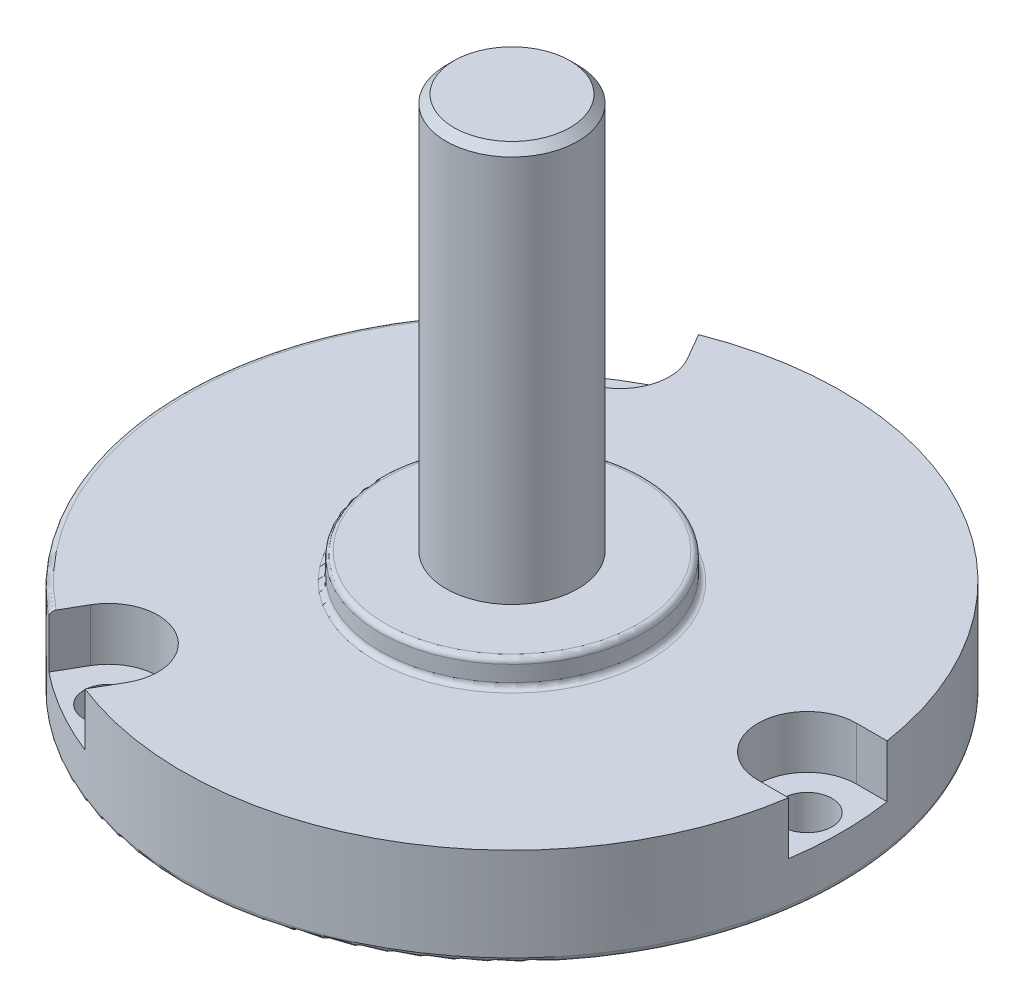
ISO-10303-21;
HEADER;
FILE_DESCRIPTION(('STEP AP214'),'2;1');
FILE_NAME('part.step','',(''),(''),'','','');
FILE_SCHEMA(('AUTOMOTIVE_DESIGN { 1 0 10303 214 1 1 1 1 }'));
ENDSEC;
DATA;
#1=APPLICATION_CONTEXT('core data for automotive mechanical design processes');
#2=APPLICATION_PROTOCOL_DEFINITION('international standard','automotive_design',2000,#1);
#3=PRODUCT_CONTEXT('',#1,'mechanical');
#4=PRODUCT('Part','Part','',(#3));
#5=PRODUCT_RELATED_PRODUCT_CATEGORY('part','',(#4));
#6=PRODUCT_DEFINITION_FORMATION('','',#4);
#7=PRODUCT_DEFINITION_CONTEXT('part definition',#1,'design');
#8=PRODUCT_DEFINITION('design','',#6,#7);
#9=PRODUCT_DEFINITION_SHAPE('','',#8);
#10=(LENGTH_UNIT() NAMED_UNIT(*) SI_UNIT(.MILLI.,.METRE.));
#11=(NAMED_UNIT(*) PLANE_ANGLE_UNIT() SI_UNIT($,.RADIAN.));
#12=(NAMED_UNIT(*) SI_UNIT($,.STERADIAN.) SOLID_ANGLE_UNIT());
#13=UNCERTAINTY_MEASURE_WITH_UNIT(LENGTH_MEASURE(1.E-05),#10,'distance_accuracy_value','');
#14=(GEOMETRIC_REPRESENTATION_CONTEXT(3) GLOBAL_UNCERTAINTY_ASSIGNED_CONTEXT((#13)) GLOBAL_UNIT_ASSIGNED_CONTEXT((#10,
#11,#12)) REPRESENTATION_CONTEXT('',''));
#15=CARTESIAN_POINT('',(0.,0.,0.));
#16=DIRECTION('',(0.,0.,1.));
#17=DIRECTION('',(1.,0.,0.));
#18=AXIS2_PLACEMENT_3D('',#15,#16,#17);
#19=CARTESIAN_POINT('',(0.,6.0198,0.));
#20=DIRECTION('',(0.,1.,0.));
#21=DIRECTION('',(0.,0.,1.));
#22=AXIS2_PLACEMENT_3D('',#19,#20,#21);
#23=PLANE('',#22);
#24=CARTESIAN_POINT('',(0.,6.0198,0.));
#25=DIRECTION('',(0.,1.,0.));
#26=DIRECTION('',(0.,0.,1.));
#27=AXIS2_PLACEMENT_3D('',#24,#25,#26);
#28=CIRCLE('',#27,6.096);
#29=CARTESIAN_POINT('',(0.,6.0198,6.096));
#30=VERTEX_POINT('',#29);
#31=EDGE_CURVE('E11',#30,#30,#28,.T.);
#32=ORIENTED_EDGE('',*,*,#31,.T.);
#33=EDGE_LOOP('',(#32));
#34=FACE_BOUND('',#33,.T.);
#35=CARTESIAN_POINT('',(0.,6.0198,0.));
#36=DIRECTION('',(0.,1.,0.));
#37=DIRECTION('',(0.,0.,1.));
#38=AXIS2_PLACEMENT_3D('',#35,#36,#37);
#39=CIRCLE('',#38,3.175);
#40=CARTESIAN_POINT('',(0.,6.0198,-3.175));
#41=VERTEX_POINT('',#40);
#42=EDGE_CURVE('E143',#41,#41,#39,.T.);
#43=ORIENTED_EDGE('',*,*,#42,.F.);
#44=EDGE_LOOP('',(#43));
#45=FACE_BOUND('',#44,.T.);
#46=ADVANCED_FACE('F35',(#34,#45),#23,.T.);
#47=CARTESIAN_POINT('',(-7.11199999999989,0.,-12.3183453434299));
#48=DIRECTION('',(0.,-1.,0.));
#49=DIRECTION('',(0.,0.,-1.));
#50=AXIS2_PLACEMENT_3D('',#47,#48,#49);
#51=CYLINDRICAL_SURFACE('',#50,1.190625);
#52=CARTESIAN_POINT('',(-7.11199999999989,0.,-12.3183453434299));
#53=DIRECTION('',(0.,-1.,0.));
#54=DIRECTION('',(0.,0.,-1.));
#55=AXIS2_PLACEMENT_3D('',#52,#53,#54);
#56=CIRCLE('',#55,1.190625);
#57=CARTESIAN_POINT('',(-7.11199999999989,0.,-13.5089703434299));
#58=VERTEX_POINT('',#57);
#59=EDGE_CURVE('E204',#58,#58,#56,.T.);
#60=ORIENTED_EDGE('',*,*,#59,.T.);
#61=EDGE_LOOP('',(#60));
#62=FACE_BOUND('',#61,.T.);
#63=CARTESIAN_POINT('',(-7.11199999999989,2.2098,-12.3183453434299));
#64=DIRECTION('',(0.,1.,0.));
#65=DIRECTION('',(0.,0.,1.));
#66=AXIS2_PLACEMENT_3D('',#63,#64,#65);
#67=CIRCLE('',#66,1.190625);
#68=CARTESIAN_POINT('',(-7.11199999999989,2.2098,-11.1277203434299));
#69=VERTEX_POINT('',#68);
#70=EDGE_CURVE('E173',#69,#69,#67,.F.);
#71=ORIENTED_EDGE('',*,*,#70,.F.);
#72=EDGE_LOOP('',(#71));
#73=FACE_BOUND('',#72,.T.);
#74=ADVANCED_FACE('F303',(#62,#73),#51,.F.);
#75=CARTESIAN_POINT('',(-7.11200000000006,0.,12.3183453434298));
#76=DIRECTION('',(0.,-1.,0.));
#77=DIRECTION('',(0.,0.,-1.));
#78=AXIS2_PLACEMENT_3D('',#75,#76,#77);
#79=CYLINDRICAL_SURFACE('',#78,1.190625);
#80=CARTESIAN_POINT('',(-7.11200000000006,0.,12.3183453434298));
#81=DIRECTION('',(0.,-1.,0.));
#82=DIRECTION('',(0.,0.,-1.));
#83=AXIS2_PLACEMENT_3D('',#80,#81,#82);
#84=CIRCLE('',#83,1.190625);
#85=CARTESIAN_POINT('',(-7.11200000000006,0.,11.1277203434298));
#86=VERTEX_POINT('',#85);
#87=EDGE_CURVE('E207',#86,#86,#84,.T.);
#88=ORIENTED_EDGE('',*,*,#87,.T.);
#89=EDGE_LOOP('',(#88));
#90=FACE_BOUND('',#89,.T.);
#91=CARTESIAN_POINT('',(-7.11200000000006,2.2098,12.3183453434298));
#92=DIRECTION('',(0.,1.,0.));
#93=DIRECTION('',(0.,0.,1.));
#94=AXIS2_PLACEMENT_3D('',#91,#92,#93);
#95=CIRCLE('',#94,1.190625);
#96=CARTESIAN_POINT('',(-7.11200000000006,2.2098,13.5089703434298));
#97=VERTEX_POINT('',#96);
#98=EDGE_CURVE('E198',#97,#97,#95,.F.);
#99=ORIENTED_EDGE('',*,*,#98,.F.);
#100=EDGE_LOOP('',(#99));
#101=FACE_BOUND('',#100,.T.);
#102=ADVANCED_FACE('F306',(#90,#101),#79,.F.);
#103=CARTESIAN_POINT('',(14.224,0.,0.));
#104=DIRECTION('',(0.,-1.,0.));
#105=DIRECTION('',(0.,0.,-1.));
#106=AXIS2_PLACEMENT_3D('',#103,#104,#105);
#107=CYLINDRICAL_SURFACE('',#106,1.190625);
#108=CARTESIAN_POINT('',(14.224,0.,0.));
#109=DIRECTION('',(0.,-1.,0.));
#110=DIRECTION('',(0.,0.,-1.));
#111=AXIS2_PLACEMENT_3D('',#108,#109,#110);
#112=CIRCLE('',#111,1.190625);
#113=CARTESIAN_POINT('',(14.224,0.,-1.190625));
#114=VERTEX_POINT('',#113);
#115=EDGE_CURVE('E240',#114,#114,#112,.T.);
#116=ORIENTED_EDGE('',*,*,#115,.T.);
#117=EDGE_LOOP('',(#116));
#118=FACE_BOUND('',#117,.T.);
#119=CARTESIAN_POINT('',(14.224,2.2098,0.));
#120=DIRECTION('',(0.,1.,0.));
#121=DIRECTION('',(0.,0.,1.));
#122=AXIS2_PLACEMENT_3D('',#119,#120,#121);
#123=CIRCLE('',#122,1.190625);
#124=CARTESIAN_POINT('',(14.224,2.2098,1.190625));
#125=VERTEX_POINT('',#124);
#126=EDGE_CURVE('E234',#125,#125,#123,.F.);
#127=ORIENTED_EDGE('',*,*,#126,.F.);
#128=EDGE_LOOP('',(#127));
#129=FACE_BOUND('',#128,.T.);
#130=ADVANCED_FACE('F310',(#118,#129),#107,.F.);
#131=CARTESIAN_POINT('',(0.,4.7498,0.));
#132=DIRECTION('',(0.,1.,0.));
#133=DIRECTION('',(0.,0.,1.));
#134=AXIS2_PLACEMENT_3D('',#131,#132,#133);
#135=PLANE('',#134);
#136=CARTESIAN_POINT('',(0.,4.7498,0.));
#137=DIRECTION('',(0.,1.,0.));
#138=DIRECTION('',(0.,0.,1.));
#139=AXIS2_PLACEMENT_3D('',#136,#137,#138);
#140=CIRCLE('',#139,6.604);
#141=CARTESIAN_POINT('',(0.,4.7498,6.604));
#142=VERTEX_POINT('',#141);
#143=EDGE_CURVE('E43',#142,#142,#140,.F.);
#144=ORIENTED_EDGE('',*,*,#143,.T.);
#145=EDGE_LOOP('',(#144));
#146=FACE_BOUND('',#145,.T.);
#147=DIRECTION('',(0.499999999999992,0.,0.866025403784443));
#148=VECTOR('',#147,1.);
#149=CARTESIAN_POINT('',(-9.16872373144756,4.7498,-11.1308953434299));
#150=LINE('',#149,#148);
#151=CARTESIAN_POINT('',(-9.77643051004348,4.7498,-12.1834743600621));
#152=VERTEX_POINT('',#151);
#153=CARTESIAN_POINT('',(-9.16872373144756,4.7498,-11.1308953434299));
#154=VERTEX_POINT('',#153);
#155=EDGE_CURVE('E131',#152,#154,#150,.T.);
#156=ORIENTED_EDGE('',*,*,#155,.F.);
#157=CARTESIAN_POINT('',(0.,4.7498,0.));
#158=DIRECTION('',(0.,1.,0.));
#159=DIRECTION('',(0.,0.,1.));
#160=AXIS2_PLACEMENT_3D('',#157,#158,#159);
#161=CIRCLE('',#160,15.621);
#162=CARTESIAN_POINT('',(-9.77643051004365,4.7498,12.183474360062));
#163=VERTEX_POINT('',#162);
#164=EDGE_CURVE('E273',#152,#163,#161,.T.);
#165=ORIENTED_EDGE('',*,*,#164,.T.);
#166=DIRECTION('',(-0.500000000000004,0.,0.866025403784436));
#167=VECTOR('',#166,1.);
#168=CARTESIAN_POINT('',(-9.16872373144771,4.7498,11.1308953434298));
#169=LINE('',#168,#167);
#170=CARTESIAN_POINT('',(-9.16872373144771,4.7498,11.1308953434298));
#171=VERTEX_POINT('',#170);
#172=EDGE_CURVE('E182',#171,#163,#169,.T.);
#173=ORIENTED_EDGE('',*,*,#172,.F.);
#174=CARTESIAN_POINT('',(-7.11200000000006,4.7498,12.3183453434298));
#175=DIRECTION('',(0.,1.,0.));
#176=DIRECTION('',(-0.866025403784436,0.,-0.500000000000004));
#177=AXIS2_PLACEMENT_3D('',#174,#175,#176);
#178=CIRCLE('',#177,2.3749);
#179=CARTESIAN_POINT('',(-5.0552762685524,4.7498,13.5057953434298));
#180=VERTEX_POINT('',#179);
#181=EDGE_CURVE('E179',#180,#171,#178,.T.);
#182=ORIENTED_EDGE('',*,*,#181,.F.);
#183=DIRECTION('',(0.500000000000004,0.,-0.866025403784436));
#184=VECTOR('',#183,1.);
#185=CARTESIAN_POINT('',(-5.0552762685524,4.7498,13.5057953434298));
#186=LINE('',#185,#184);
#187=CARTESIAN_POINT('',(-5.79145241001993,4.7498,14.7808898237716));
#188=VERTEX_POINT('',#187);
#189=EDGE_CURVE('E176',#188,#180,#186,.T.);
#190=ORIENTED_EDGE('',*,*,#189,.F.);
#191=CARTESIAN_POINT('',(0.,4.7498,0.));
#192=DIRECTION('',(0.,1.,0.));
#193=DIRECTION('',(0.,0.,1.));
#194=AXIS2_PLACEMENT_3D('',#191,#192,#193);
#195=CIRCLE('',#194,15.875);
#196=CARTESIAN_POINT('',(15.696352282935,4.7498,2.3749));
#197=VERTEX_POINT('',#196);
#198=EDGE_CURVE('E243',#188,#197,#195,.T.);
#199=ORIENTED_EDGE('',*,*,#198,.T.);
#200=DIRECTION('',(1.,0.,0.));
#201=VECTOR('',#200,1.);
#202=CARTESIAN_POINT('',(14.224,4.7498,2.3749));
#203=LINE('',#202,#201);
#204=CARTESIAN_POINT('',(14.224,4.7498,2.3749));
#205=VERTEX_POINT('',#204);
#206=EDGE_CURVE('E216',#205,#197,#203,.T.);
#207=ORIENTED_EDGE('',*,*,#206,.F.);
#208=CARTESIAN_POINT('',(14.224,4.7498,0.));
#209=DIRECTION('',(0.,1.,0.));
#210=DIRECTION('',(0.,0.,1.));
#211=AXIS2_PLACEMENT_3D('',#208,#209,#210);
#212=CIRCLE('',#211,2.3749);
#213=CARTESIAN_POINT('',(14.224,4.7498,-2.3749));
#214=VERTEX_POINT('',#213);
#215=EDGE_CURVE('E213',#214,#205,#212,.T.);
#216=ORIENTED_EDGE('',*,*,#215,.F.);
#217=DIRECTION('',(-1.,0.,0.));
#218=VECTOR('',#217,1.);
#219=CARTESIAN_POINT('',(14.224,4.7498,-2.3749));
#220=LINE('',#219,#218);
#221=CARTESIAN_POINT('',(15.696352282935,4.7498,-2.3749));
#222=VERTEX_POINT('',#221);
#223=EDGE_CURVE('E210',#222,#214,#220,.T.);
#224=ORIENTED_EDGE('',*,*,#223,.F.);
#225=CARTESIAN_POINT('',(-5.79145241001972,4.7498,-14.7808898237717));
#226=VERTEX_POINT('',#225);
#227=EDGE_CURVE('E244',#222,#226,#195,.T.);
#228=ORIENTED_EDGE('',*,*,#227,.T.);
#229=DIRECTION('',(-0.499999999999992,0.,-0.866025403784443));
#230=VECTOR('',#229,1.);
#231=CARTESIAN_POINT('',(-5.05527626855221,4.7498,-13.5057953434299));
#232=LINE('',#231,#230);
#233=CARTESIAN_POINT('',(-5.05527626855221,4.7498,-13.5057953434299));
#234=VERTEX_POINT('',#233);
#235=EDGE_CURVE('E157',#234,#226,#232,.T.);
#236=ORIENTED_EDGE('',*,*,#235,.F.);
#237=CARTESIAN_POINT('',(-7.11199999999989,4.7498,-12.3183453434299));
#238=DIRECTION('',(0.,1.,0.));
#239=DIRECTION('',(0.866025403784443,0.,-0.499999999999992));
#240=AXIS2_PLACEMENT_3D('',#237,#238,#239);
#241=CIRCLE('',#240,2.3749);
#242=EDGE_CURVE('E142',#154,#234,#241,.T.);
#243=ORIENTED_EDGE('',*,*,#242,.F.);
#244=EDGE_LOOP('',(#156,#165,#173,#182,#190,#199,#207,#216,#224,#228,#236,#243));
#245=FACE_BOUND('',#244,.T.);
#246=ADVANCED_FACE('F155',(#146,#245),#135,.T.);
#247=CARTESIAN_POINT('',(0.,4.7498,0.));
#248=DIRECTION('',(0.,-1.,0.));
#249=DIRECTION('',(0.,0.,-1.));
#250=AXIS2_PLACEMENT_3D('',#247,#248,#249);
#251=CYLINDRICAL_SURFACE('',#250,15.875);
#252=CARTESIAN_POINT('',(0.,0.254,0.));
#253=DIRECTION('',(0.,1.,0.));
#254=DIRECTION('',(0.,0.,1.));
#255=AXIS2_PLACEMENT_3D('',#252,#253,#254);
#256=CIRCLE('',#255,15.875);
#257=CARTESIAN_POINT('',(0.,0.254,15.875));
#258=VERTEX_POINT('',#257);
#259=EDGE_CURVE('E281',#258,#258,#256,.T.);
#260=ORIENTED_EDGE('',*,*,#259,.T.);
#261=EDGE_LOOP('',(#260));
#262=FACE_BOUND('',#261,.T.);
#263=DIRECTION('',(0.,1.,0.));
#264=VECTOR('',#263,1.);
#265=CARTESIAN_POINT('',(-9.90489987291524,2.2098,12.4059898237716));
#266=LINE('',#265,#264);
#267=CARTESIAN_POINT('',(-9.90489987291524,2.2098,12.4059898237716));
#268=VERTEX_POINT('',#267);
#269=CARTESIAN_POINT('',(-9.90489987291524,4.4958,12.4059898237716));
#270=VERTEX_POINT('',#269);
#271=EDGE_CURVE('E196',#268,#270,#266,.T.);
#272=ORIENTED_EDGE('',*,*,#271,.T.);
#273=CARTESIAN_POINT('',(0.,4.4958,0.));
#274=DIRECTION('',(0.,1.,0.));
#275=DIRECTION('',(0.,0.,1.));
#276=AXIS2_PLACEMENT_3D('',#273,#274,#275);
#277=CIRCLE('',#276,15.875);
#278=CARTESIAN_POINT('',(-9.90489987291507,4.4958,-12.4059898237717));
#279=VERTEX_POINT('',#278);
#280=EDGE_CURVE('E50',#270,#279,#277,.F.);
#281=ORIENTED_EDGE('',*,*,#280,.T.);
#282=DIRECTION('',(0.,1.,0.));
#283=VECTOR('',#282,1.);
#284=CARTESIAN_POINT('',(-9.90489987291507,2.2098,-12.4059898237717));
#285=LINE('',#284,#283);
#286=CARTESIAN_POINT('',(-9.90489987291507,2.2098,-12.4059898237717));
#287=VERTEX_POINT('',#286);
#288=EDGE_CURVE('E153',#287,#279,#285,.T.);
#289=ORIENTED_EDGE('',*,*,#288,.F.);
#290=CARTESIAN_POINT('',(0.,2.2098,0.));
#291=DIRECTION('',(0.,1.,0.));
#292=DIRECTION('',(0.866025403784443,0.,-0.499999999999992));
#293=AXIS2_PLACEMENT_3D('',#290,#291,#292);
#294=CIRCLE('',#293,15.875);
#295=CARTESIAN_POINT('',(-5.79145241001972,2.2098,-14.7808898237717));
#296=VERTEX_POINT('',#295);
#297=EDGE_CURVE('E159',#296,#287,#294,.T.);
#298=ORIENTED_EDGE('',*,*,#297,.F.);
#299=DIRECTION('',(0.,1.,0.));
#300=VECTOR('',#299,1.);
#301=CARTESIAN_POINT('',(-5.79145241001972,2.2098,-14.7808898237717));
#302=LINE('',#301,#300);
#303=EDGE_CURVE('E170',#296,#226,#302,.T.);
#304=ORIENTED_EDGE('',*,*,#303,.T.);
#305=ORIENTED_EDGE('',*,*,#227,.F.);
#306=DIRECTION('',(0.,1.,0.));
#307=VECTOR('',#306,1.);
#308=CARTESIAN_POINT('',(15.696352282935,2.2098,-2.3749));
#309=LINE('',#308,#307);
#310=CARTESIAN_POINT('',(15.696352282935,2.2098,-2.3749));
#311=VERTEX_POINT('',#310);
#312=EDGE_CURVE('E230',#311,#222,#309,.T.);
#313=ORIENTED_EDGE('',*,*,#312,.F.);
#314=CARTESIAN_POINT('',(0.,2.2098,0.));
#315=DIRECTION('',(0.,1.,0.));
#316=DIRECTION('',(0.,0.,1.));
#317=AXIS2_PLACEMENT_3D('',#314,#315,#316);
#318=CIRCLE('',#317,15.875);
#319=CARTESIAN_POINT('',(15.696352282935,2.2098,2.3749));
#320=VERTEX_POINT('',#319);
#321=EDGE_CURVE('E219',#320,#311,#318,.T.);
#322=ORIENTED_EDGE('',*,*,#321,.F.);
#323=DIRECTION('',(0.,1.,0.));
#324=VECTOR('',#323,1.);
#325=CARTESIAN_POINT('',(15.696352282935,2.2098,2.3749));
#326=LINE('',#325,#324);
#327=EDGE_CURVE('E231',#320,#197,#326,.T.);
#328=ORIENTED_EDGE('',*,*,#327,.T.);
#329=ORIENTED_EDGE('',*,*,#198,.F.);
#330=DIRECTION('',(0.,1.,0.));
#331=VECTOR('',#330,1.);
#332=CARTESIAN_POINT('',(-5.79145241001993,2.2098,14.7808898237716));
#333=LINE('',#332,#331);
#334=CARTESIAN_POINT('',(-5.79145241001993,2.2098,14.7808898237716));
#335=VERTEX_POINT('',#334);
#336=EDGE_CURVE('E195',#335,#188,#333,.T.);
#337=ORIENTED_EDGE('',*,*,#336,.F.);
#338=CARTESIAN_POINT('',(0.,2.2098,0.));
#339=DIRECTION('',(0.,1.,0.));
#340=DIRECTION('',(-0.866025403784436,0.,-0.500000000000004));
#341=AXIS2_PLACEMENT_3D('',#338,#339,#340);
#342=CIRCLE('',#341,15.875);
#343=EDGE_CURVE('E184',#268,#335,#342,.T.);
#344=ORIENTED_EDGE('',*,*,#343,.F.);
#345=EDGE_LOOP('',(#272,#281,#289,#298,#304,#305,#313,#322,#328,#329,#337,#344));
#346=FACE_BOUND('',#345,.T.);
#347=ADVANCED_FACE('F349',(#262,#346),#251,.T.);
#348=CARTESIAN_POINT('',(0.,0.,0.));
#349=DIRECTION('',(0.,1.,0.));
#350=DIRECTION('',(0.,0.,1.));
#351=AXIS2_PLACEMENT_3D('',#348,#349,#350);
#352=PLANE('',#351);
#353=CARTESIAN_POINT('',(0.,0.,0.));
#354=DIRECTION('',(0.,1.,0.));
#355=DIRECTION('',(0.,0.,1.));
#356=AXIS2_PLACEMENT_3D('',#353,#354,#355);
#357=CIRCLE('',#356,11.938);
#358=CARTESIAN_POINT('',(0.,0.,11.938));
#359=VERTEX_POINT('',#358);
#360=EDGE_CURVE('E270',#359,#359,#357,.T.);
#361=ORIENTED_EDGE('',*,*,#360,.T.);
#362=EDGE_LOOP('',(#361));
#363=FACE_BOUND('',#362,.T.);
#364=CARTESIAN_POINT('',(0.,0.,0.));
#365=DIRECTION('',(0.,1.,0.));
#366=DIRECTION('',(0.,0.,1.));
#367=AXIS2_PLACEMENT_3D('',#364,#365,#366);
#368=CIRCLE('',#367,15.621);
#369=CARTESIAN_POINT('',(0.,0.,15.621));
#370=VERTEX_POINT('',#369);
#371=EDGE_CURVE('E267',#370,#370,#368,.F.);
#372=ORIENTED_EDGE('',*,*,#371,.T.);
#373=EDGE_LOOP('',(#372));
#374=FACE_BOUND('',#373,.T.);
#375=ORIENTED_EDGE('',*,*,#59,.F.);
#376=EDGE_LOOP('',(#375));
#377=FACE_BOUND('',#376,.T.);
#378=ORIENTED_EDGE('',*,*,#87,.F.);
#379=EDGE_LOOP('',(#378));
#380=FACE_BOUND('',#379,.T.);
#381=ORIENTED_EDGE('',*,*,#115,.F.);
#382=EDGE_LOOP('',(#381));
#383=FACE_BOUND('',#382,.T.);
#384=ADVANCED_FACE('F345',(#363,#374,#377,#380,#383),#352,.F.);
#385=CARTESIAN_POINT('',(0.,6.0198,0.));
#386=DIRECTION('',(0.,-1.,0.));
#387=DIRECTION('',(0.,0.,-1.));
#388=AXIS2_PLACEMENT_3D('',#385,#386,#387);
#389=CYLINDRICAL_SURFACE('',#388,6.35);
#390=CARTESIAN_POINT('',(0.,5.0038,0.));
#391=DIRECTION('',(0.,1.,0.));
#392=DIRECTION('',(0.,0.,1.));
#393=AXIS2_PLACEMENT_3D('',#390,#391,#392);
#394=CIRCLE('',#393,6.35);
#395=CARTESIAN_POINT('',(0.,5.0038,6.35));
#396=VERTEX_POINT('',#395);
#397=EDGE_CURVE('E515',#396,#396,#394,.T.);
#398=ORIENTED_EDGE('',*,*,#397,.T.);
#399=EDGE_LOOP('',(#398));
#400=FACE_BOUND('',#399,.T.);
#401=CARTESIAN_POINT('',(0.,5.7658,0.));
#402=DIRECTION('',(0.,1.,0.));
#403=DIRECTION('',(0.,0.,1.));
#404=AXIS2_PLACEMENT_3D('',#401,#402,#403);
#405=CIRCLE('',#404,6.35);
#406=CARTESIAN_POINT('',(0.,5.7658,6.35));
#407=VERTEX_POINT('',#406);
#408=EDGE_CURVE('E400',#407,#407,#405,.F.);
#409=ORIENTED_EDGE('',*,*,#408,.T.);
#410=EDGE_LOOP('',(#409));
#411=FACE_BOUND('',#410,.T.);
#412=ADVANCED_FACE('F338',(#400,#411),#389,.T.);
#413=CARTESIAN_POINT('',(0.,0.762,0.));
#414=DIRECTION('',(0.,-1.,0.));
#415=DIRECTION('',(0.,0.,-1.));
#416=AXIS2_PLACEMENT_3D('',#413,#414,#415);
#417=CYLINDRICAL_SURFACE('',#416,11.684);
#418=CARTESIAN_POINT('',(0.,0.508,0.));
#419=DIRECTION('',(0.,-1.,0.));
#420=DIRECTION('',(0.,0.,-1.));
#421=AXIS2_PLACEMENT_3D('',#418,#419,#420);
#422=CIRCLE('',#421,11.684);
#423=CARTESIAN_POINT('',(0.,0.508,-11.684));
#424=VERTEX_POINT('',#423);
#425=EDGE_CURVE('E264',#424,#424,#422,.F.);
#426=CARTESIAN_POINT('',(0.,0.254,0.));
#427=DIRECTION('',(0.,1.,0.));
#428=DIRECTION('',(0.,0.,1.));
#429=AXIS2_PLACEMENT_3D('',#426,#427,#428);
#430=CIRCLE('',#429,11.684);
#431=CARTESIAN_POINT('',(0.,0.254,-11.684));
#432=VERTEX_POINT('',#431);
#433=EDGE_CURVE('E261',#432,#432,#430,.F.);
#434=CARTESIAN_POINT('',(0.,0.508,-11.684));
#435=CARTESIAN_POINT('',(0.,0.505354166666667,-11.684));
#436=CARTESIAN_POINT('',(0.,0.502708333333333,-11.684));
#437=CARTESIAN_POINT('',(0.,0.497416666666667,-11.684));
#438=CARTESIAN_POINT('',(0.,0.494770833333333,-11.684));
#439=CARTESIAN_POINT('',(0.,0.489479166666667,-11.684));
#440=CARTESIAN_POINT('',(0.,0.486833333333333,-11.684));
#441=CARTESIAN_POINT('',(0.,0.481541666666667,-11.684));
#442=CARTESIAN_POINT('',(0.,0.478895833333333,-11.684));
#443=CARTESIAN_POINT('',(0.,0.473604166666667,-11.684));
#444=CARTESIAN_POINT('',(0.,0.470958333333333,-11.684));
#445=CARTESIAN_POINT('',(0.,0.465666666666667,-11.684));
#446=CARTESIAN_POINT('',(0.,0.463020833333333,-11.684));
#447=CARTESIAN_POINT('',(0.,0.457729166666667,-11.684));
#448=CARTESIAN_POINT('',(0.,0.455083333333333,-11.684));
#449=CARTESIAN_POINT('',(0.,0.449791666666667,-11.684));
#450=CARTESIAN_POINT('',(0.,0.447145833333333,-11.684));
#451=CARTESIAN_POINT('',(0.,0.441854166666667,-11.684));
#452=CARTESIAN_POINT('',(0.,0.439208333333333,-11.684));
#453=CARTESIAN_POINT('',(0.,0.433916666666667,-11.684));
#454=CARTESIAN_POINT('',(0.,0.431270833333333,-11.684));
#455=CARTESIAN_POINT('',(0.,0.425979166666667,-11.684));
#456=CARTESIAN_POINT('',(0.,0.423333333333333,-11.684));
#457=CARTESIAN_POINT('',(0.,0.418041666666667,-11.684));
#458=CARTESIAN_POINT('',(0.,0.415395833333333,-11.684));
#459=CARTESIAN_POINT('',(0.,0.410104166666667,-11.684));
#460=CARTESIAN_POINT('',(0.,0.407458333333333,-11.684));
#461=CARTESIAN_POINT('',(0.,0.402166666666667,-11.684));
#462=CARTESIAN_POINT('',(0.,0.399520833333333,-11.684));
#463=CARTESIAN_POINT('',(0.,0.394229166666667,-11.684));
#464=CARTESIAN_POINT('',(0.,0.391583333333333,-11.684));
#465=CARTESIAN_POINT('',(0.,0.386291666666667,-11.684));
#466=CARTESIAN_POINT('',(0.,0.383645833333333,-11.684));
#467=CARTESIAN_POINT('',(0.,0.378354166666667,-11.684));
#468=CARTESIAN_POINT('',(0.,0.375708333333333,-11.684));
#469=CARTESIAN_POINT('',(0.,0.370416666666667,-11.684));
#470=CARTESIAN_POINT('',(0.,0.367770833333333,-11.684));
#471=CARTESIAN_POINT('',(0.,0.362479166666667,-11.684));
#472=CARTESIAN_POINT('',(0.,0.359833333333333,-11.684));
#473=CARTESIAN_POINT('',(0.,0.354541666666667,-11.684));
#474=CARTESIAN_POINT('',(0.,0.351895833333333,-11.684));
#475=CARTESIAN_POINT('',(0.,0.346604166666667,-11.684));
#476=CARTESIAN_POINT('',(0.,0.343958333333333,-11.684));
#477=CARTESIAN_POINT('',(0.,0.338666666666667,-11.684));
#478=CARTESIAN_POINT('',(0.,0.336020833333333,-11.684));
#479=CARTESIAN_POINT('',(0.,0.330729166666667,-11.684));
#480=CARTESIAN_POINT('',(0.,0.328083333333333,-11.684));
#481=CARTESIAN_POINT('',(0.,0.322791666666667,-11.684));
#482=CARTESIAN_POINT('',(0.,0.320145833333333,-11.684));
#483=CARTESIAN_POINT('',(0.,0.314854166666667,-11.684));
#484=CARTESIAN_POINT('',(0.,0.312208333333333,-11.684));
#485=CARTESIAN_POINT('',(0.,0.306916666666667,-11.684));
#486=CARTESIAN_POINT('',(0.,0.304270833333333,-11.684));
#487=CARTESIAN_POINT('',(0.,0.298979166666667,-11.684));
#488=CARTESIAN_POINT('',(0.,0.296333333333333,-11.684));
#489=CARTESIAN_POINT('',(0.,0.291041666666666,-11.684));
#490=CARTESIAN_POINT('',(0.,0.288395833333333,-11.684));
#491=CARTESIAN_POINT('',(0.,0.283104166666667,-11.684));
#492=CARTESIAN_POINT('',(0.,0.280458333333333,-11.684));
#493=CARTESIAN_POINT('',(0.,0.275166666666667,-11.684));
#494=CARTESIAN_POINT('',(0.,0.272520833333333,-11.684));
#495=CARTESIAN_POINT('',(0.,0.267229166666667,-11.684));
#496=CARTESIAN_POINT('',(0.,0.264583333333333,-11.684));
#497=CARTESIAN_POINT('',(0.,0.259291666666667,-11.684));
#498=CARTESIAN_POINT('',(0.,0.256645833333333,-11.684));
#499=CARTESIAN_POINT('',(0.,0.254,-11.684));
#500=B_SPLINE_CURVE_WITH_KNOTS('',3,(#434,#435,#436,#437,#438,#439,#440,#441,#442,#443,#444,
#445,#446,#447,#448,#449,#450,#451,#452,#453,#454,#455,#456,#457,#458,#459,#460,#461,#462,#463,
#464,#465,#466,#467,#468,#469,#470,#471,#472,#473,#474,#475,#476,#477,#478,#479,#480,#481,#482,
#483,#484,#485,#486,#487,#488,#489,#490,#491,#492,#493,#494,#495,#496,#497,#498,#499),
.UNSPECIFIED.,.F.,.F.,(4,2,2,2,2,2,2,2,2,2,2,2,2,2,2,2,2,2,2,2,2,2,2,2,2,2,2,2,2,2,2,2,4),(0.,
0.00793749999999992,0.0158749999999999,0.0238125,0.03175,0.0396875,0.047625,0.0555625,0.0635,
0.0714375,0.079375,0.0873125,0.09525,0.1031875,0.111125,0.1190625,0.127,0.1349375,0.142875,
0.1508125,0.15875,0.1666875,0.174625,0.1825625,0.1905,0.1984375,0.206375,0.2143125,0.22225,
0.2301875,0.238125,0.2460625,0.254),.UNSPECIFIED.);
#501=EDGE_CURVE('BSEAM334',#424,#432,#500,.T.);
#502=ORIENTED_EDGE('',*,*,#425,.T.);
#503=ORIENTED_EDGE('',*,*,#433,.T.);
#504=ORIENTED_EDGE('',*,*,#501,.T.);
#505=ORIENTED_EDGE('',*,*,#501,.F.);
#506=EDGE_LOOP('',(#502,#504,#503,#505));
#507=FACE_BOUND('',#506,.T.);
#508=ADVANCED_FACE('F334',(#507),#417,.F.);
#509=CARTESIAN_POINT('',(0.,0.762,0.));
#510=DIRECTION('',(0.,-1.,0.));
#511=DIRECTION('',(0.,0.,-1.));
#512=AXIS2_PLACEMENT_3D('',#509,#510,#511);
#513=PLANE('',#512);
#514=CARTESIAN_POINT('',(0.,0.762,0.));
#515=DIRECTION('',(0.,-1.,0.));
#516=DIRECTION('',(0.,0.,-1.));
#517=AXIS2_PLACEMENT_3D('',#514,#515,#516);
#518=CIRCLE('',#517,11.43);
#519=CARTESIAN_POINT('',(0.,0.762,-11.43));
#520=VERTEX_POINT('',#519);
#521=EDGE_CURVE('E258',#520,#520,#518,.T.);
#522=ORIENTED_EDGE('',*,*,#521,.T.);
#523=EDGE_LOOP('',(#522));
#524=FACE_BOUND('',#523,.T.);
#525=ADVANCED_FACE('F316',(#524),#513,.T.);
#526=CARTESIAN_POINT('',(0.,2.2098,0.));
#527=DIRECTION('',(0.,1.,0.));
#528=DIRECTION('',(0.,0.,1.));
#529=AXIS2_PLACEMENT_3D('',#526,#527,#528);
#530=PLANE('',#529);
#531=ORIENTED_EDGE('',*,*,#321,.T.);
#532=DIRECTION('',(-1.,0.,0.));
#533=VECTOR('',#532,1.);
#534=CARTESIAN_POINT('',(14.224,2.2098,-2.3749));
#535=LINE('',#534,#533);
#536=CARTESIAN_POINT('',(14.224,2.2098,-2.3749));
#537=VERTEX_POINT('',#536);
#538=EDGE_CURVE('E222',#311,#537,#535,.T.);
#539=ORIENTED_EDGE('',*,*,#538,.T.);
#540=CARTESIAN_POINT('',(14.224,2.2098,0.));
#541=DIRECTION('',(0.,1.,0.));
#542=DIRECTION('',(0.,0.,1.));
#543=AXIS2_PLACEMENT_3D('',#540,#541,#542);
#544=CIRCLE('',#543,2.3749);
#545=CARTESIAN_POINT('',(14.224,2.2098,2.3749));
#546=VERTEX_POINT('',#545);
#547=EDGE_CURVE('E225',#537,#546,#544,.T.);
#548=ORIENTED_EDGE('',*,*,#547,.T.);
#549=DIRECTION('',(1.,0.,0.));
#550=VECTOR('',#549,1.);
#551=CARTESIAN_POINT('',(14.224,2.2098,2.3749));
#552=LINE('',#551,#550);
#553=EDGE_CURVE('E228',#546,#320,#552,.T.);
#554=ORIENTED_EDGE('',*,*,#553,.T.);
#555=EDGE_LOOP('',(#531,#539,#548,#554));
#556=FACE_BOUND('',#555,.T.);
#557=ORIENTED_EDGE('',*,*,#126,.T.);
#558=EDGE_LOOP('',(#557));
#559=FACE_BOUND('',#558,.T.);
#560=ADVANCED_FACE('F312',(#556,#559),#530,.T.);
#561=CARTESIAN_POINT('',(14.224,2.2098,2.3749));
#562=DIRECTION('',(0.,0.,1.));
#563=DIRECTION('',(1.,0.,0.));
#564=AXIS2_PLACEMENT_3D('',#561,#562,#563);
#565=PLANE('',#564);
#566=ORIENTED_EDGE('',*,*,#206,.T.);
#567=ORIENTED_EDGE('',*,*,#327,.F.);
#568=ORIENTED_EDGE('',*,*,#553,.F.);
#569=DIRECTION('',(0.,1.,0.));
#570=VECTOR('',#569,1.);
#571=CARTESIAN_POINT('',(14.224,2.2098,2.3749));
#572=LINE('',#571,#570);
#573=EDGE_CURVE('E235',#546,#205,#572,.T.);
#574=ORIENTED_EDGE('',*,*,#573,.T.);
#575=EDGE_LOOP('',(#566,#567,#568,#574));
#576=FACE_BOUND('',#575,.T.);
#577=ADVANCED_FACE('F315',(#576),#565,.F.);
#578=CARTESIAN_POINT('',(14.224,2.2098,0.));
#579=DIRECTION('',(0.,1.,0.));
#580=DIRECTION('',(0.,0.,1.));
#581=AXIS2_PLACEMENT_3D('',#578,#579,#580);
#582=CYLINDRICAL_SURFACE('',#581,2.3749);
#583=ORIENTED_EDGE('',*,*,#215,.T.);
#584=ORIENTED_EDGE('',*,*,#573,.F.);
#585=ORIENTED_EDGE('',*,*,#547,.F.);
#586=DIRECTION('',(0.,1.,0.));
#587=VECTOR('',#586,1.);
#588=CARTESIAN_POINT('',(14.224,2.2098,-2.3749));
#589=LINE('',#588,#587);
#590=EDGE_CURVE('E237',#537,#214,#589,.T.);
#591=ORIENTED_EDGE('',*,*,#590,.T.);
#592=EDGE_LOOP('',(#583,#584,#585,#591));
#593=FACE_BOUND('',#592,.T.);
#594=ADVANCED_FACE('F320',(#593),#582,.F.);
#595=CARTESIAN_POINT('',(14.224,2.2098,-2.3749));
#596=DIRECTION('',(0.,0.,-1.));
#597=DIRECTION('',(-1.,0.,0.));
#598=AXIS2_PLACEMENT_3D('',#595,#596,#597);
#599=PLANE('',#598);
#600=ORIENTED_EDGE('',*,*,#223,.T.);
#601=ORIENTED_EDGE('',*,*,#590,.F.);
#602=ORIENTED_EDGE('',*,*,#538,.F.);
#603=ORIENTED_EDGE('',*,*,#312,.T.);
#604=EDGE_LOOP('',(#600,#601,#602,#603));
#605=FACE_BOUND('',#604,.T.);
#606=ADVANCED_FACE('F324',(#605),#599,.F.);
#607=CARTESIAN_POINT('',(0.,2.2098,0.));
#608=DIRECTION('',(0.,1.,0.));
#609=DIRECTION('',(-0.866025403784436,0.,-0.500000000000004));
#610=AXIS2_PLACEMENT_3D('',#607,#608,#609);
#611=PLANE('',#610);
#612=ORIENTED_EDGE('',*,*,#343,.T.);
#613=DIRECTION('',(0.500000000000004,0.,-0.866025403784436));
#614=VECTOR('',#613,1.);
#615=CARTESIAN_POINT('',(-5.0552762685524,2.2098,13.5057953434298));
#616=LINE('',#615,#614);
#617=CARTESIAN_POINT('',(-5.0552762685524,2.2098,13.5057953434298));
#618=VERTEX_POINT('',#617);
#619=EDGE_CURVE('E187',#335,#618,#616,.T.);
#620=ORIENTED_EDGE('',*,*,#619,.T.);
#621=CARTESIAN_POINT('',(-7.11200000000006,2.2098,12.3183453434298));
#622=DIRECTION('',(0.,1.,0.));
#623=DIRECTION('',(-0.866025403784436,0.,-0.500000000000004));
#624=AXIS2_PLACEMENT_3D('',#621,#622,#623);
#625=CIRCLE('',#624,2.3749);
#626=CARTESIAN_POINT('',(-9.16872373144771,2.2098,11.1308953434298));
#627=VERTEX_POINT('',#626);
#628=EDGE_CURVE('E190',#618,#627,#625,.T.);
#629=ORIENTED_EDGE('',*,*,#628,.T.);
#630=DIRECTION('',(-0.500000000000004,0.,0.866025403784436));
#631=VECTOR('',#630,1.);
#632=CARTESIAN_POINT('',(-9.16872373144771,2.2098,11.1308953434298));
#633=LINE('',#632,#631);
#634=EDGE_CURVE('E193',#627,#268,#633,.T.);
#635=ORIENTED_EDGE('',*,*,#634,.T.);
#636=EDGE_LOOP('',(#612,#620,#629,#635));
#637=FACE_BOUND('',#636,.T.);
#638=ORIENTED_EDGE('',*,*,#98,.T.);
#639=EDGE_LOOP('',(#638));
#640=FACE_BOUND('',#639,.T.);
#641=ADVANCED_FACE('F293',(#637,#640),#611,.T.);
#642=CARTESIAN_POINT('',(-9.16872373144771,2.2098,11.1308953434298));
#643=DIRECTION('',(-0.866025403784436,0.,-0.500000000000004));
#644=DIRECTION('',(-0.500000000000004,0.,0.866025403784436));
#645=AXIS2_PLACEMENT_3D('',#642,#643,#644);
#646=PLANE('',#645);
#647=ORIENTED_EDGE('',*,*,#172,.T.);
#648=CARTESIAN_POINT('',(-9.77643051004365,4.7498,12.183474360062));
#649=CARTESIAN_POINT('',(-9.78371973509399,4.74981158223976,12.196099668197));
#650=CARTESIAN_POINT('',(-9.79100767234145,4.74857456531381,12.2087227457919));
#651=CARTESIAN_POINT('',(-9.80537524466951,4.74368702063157,12.2336081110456));
#652=CARTESIAN_POINT('',(-9.81245496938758,4.74003754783,12.2458705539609));
#653=CARTESIAN_POINT('',(-9.82621126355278,4.7304057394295,12.2696971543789));
#654=CARTESIAN_POINT('',(-9.8328875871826,4.72442199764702,12.2812608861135));
#655=CARTESIAN_POINT('',(-9.84563781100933,4.71028786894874,12.3033449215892));
#656=CARTESIAN_POINT('',(-9.85171187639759,4.70213807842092,12.3138655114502));
#657=CARTESIAN_POINT('',(-9.86304915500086,4.6839443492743,12.3335022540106));
#658=CARTESIAN_POINT('',(-9.86831663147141,4.67391104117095,12.3426257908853));
#659=CARTESIAN_POINT('',(-9.87792438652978,4.65219809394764,12.3592669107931));
#660=CARTESIAN_POINT('',(-9.88226450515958,4.64051817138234,12.3667842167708));
#661=CARTESIAN_POINT('',(-9.88984269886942,4.61598159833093,12.3799100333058));
#662=CARTESIAN_POINT('',(-9.89309211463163,4.6031389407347,12.3855381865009));
#663=CARTESIAN_POINT('',(-9.89845223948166,4.5765404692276,12.394822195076));
#664=CARTESIAN_POINT('',(-9.90056380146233,4.56278534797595,12.3984795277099));
#665=CARTESIAN_POINT('',(-9.90301364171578,4.54007598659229,12.4027227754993));
#666=CARTESIAN_POINT('',(-9.90372056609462,4.53127409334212,12.4039472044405));
#667=CARTESIAN_POINT('',(-9.90466357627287,4.51358279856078,12.4055805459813));
#668=CARTESIAN_POINT('',(-9.90490033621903,4.50469354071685,12.4059906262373));
#669=CARTESIAN_POINT('',(-9.90489987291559,4.49580000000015,12.4059898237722));
#670=B_SPLINE_CURVE_WITH_KNOTS('',3,(#648,#649,#650,#651,#652,#653,#654,#655,#656,#657,#658,
#659,#660,#661,#662,#663,#664,#665,#666,#667,#668,#669),.UNSPECIFIED.,.F.,.F.,(4,2,2,2,2,2,2,2,
2,2,4),(0.,0.0436794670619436,0.0873398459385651,0.131026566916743,0.174701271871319,
0.218136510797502,0.261579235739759,0.304555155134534,0.347498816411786,0.374196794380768,
0.400856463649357),.UNSPECIFIED.);
#671=EDGE_CURVE('E58',#163,#270,#670,.T.);
#672=ORIENTED_EDGE('',*,*,#671,.T.);
#673=ORIENTED_EDGE('',*,*,#271,.F.);
#674=ORIENTED_EDGE('',*,*,#634,.F.);
#675=DIRECTION('',(0.,1.,0.));
#676=VECTOR('',#675,1.);
#677=CARTESIAN_POINT('',(-9.16872373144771,2.2098,11.1308953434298));
#678=LINE('',#677,#676);
#679=EDGE_CURVE('E199',#627,#171,#678,.T.);
#680=ORIENTED_EDGE('',*,*,#679,.T.);
#681=EDGE_LOOP('',(#647,#672,#673,#674,#680));
#682=FACE_BOUND('',#681,.T.);
#683=ADVANCED_FACE('F287',(#682),#646,.F.);
#684=CARTESIAN_POINT('',(-7.11200000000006,2.2098,12.3183453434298));
#685=DIRECTION('',(0.,1.,0.));
#686=DIRECTION('',(0.,0.,1.));
#687=AXIS2_PLACEMENT_3D('',#684,#685,#686);
#688=CYLINDRICAL_SURFACE('',#687,2.3749);
#689=ORIENTED_EDGE('',*,*,#181,.T.);
#690=ORIENTED_EDGE('',*,*,#679,.F.);
#691=ORIENTED_EDGE('',*,*,#628,.F.);
#692=DIRECTION('',(0.,1.,0.));
#693=VECTOR('',#692,1.);
#694=CARTESIAN_POINT('',(-5.0552762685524,2.2098,13.5057953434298));
#695=LINE('',#694,#693);
#696=EDGE_CURVE('E201',#618,#180,#695,.T.);
#697=ORIENTED_EDGE('',*,*,#696,.T.);
#698=EDGE_LOOP('',(#689,#690,#691,#697));
#699=FACE_BOUND('',#698,.T.);
#700=ADVANCED_FACE('F292',(#699),#688,.F.);
#701=CARTESIAN_POINT('',(-5.0552762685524,2.2098,13.5057953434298));
#702=DIRECTION('',(0.866025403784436,0.,0.500000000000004));
#703=DIRECTION('',(0.500000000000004,0.,-0.866025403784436));
#704=AXIS2_PLACEMENT_3D('',#701,#702,#703);
#705=PLANE('',#704);
#706=ORIENTED_EDGE('',*,*,#189,.T.);
#707=ORIENTED_EDGE('',*,*,#696,.F.);
#708=ORIENTED_EDGE('',*,*,#619,.F.);
#709=ORIENTED_EDGE('',*,*,#336,.T.);
#710=EDGE_LOOP('',(#706,#707,#708,#709));
#711=FACE_BOUND('',#710,.T.);
#712=ADVANCED_FACE('F297',(#711),#705,.F.);
#713=CARTESIAN_POINT('',(0.,2.2098,0.));
#714=DIRECTION('',(0.,1.,0.));
#715=DIRECTION('',(0.866025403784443,0.,-0.499999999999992));
#716=AXIS2_PLACEMENT_3D('',#713,#714,#715);
#717=PLANE('',#716);
#718=ORIENTED_EDGE('',*,*,#297,.T.);
#719=DIRECTION('',(0.499999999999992,0.,0.866025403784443));
#720=VECTOR('',#719,1.);
#721=CARTESIAN_POINT('',(-9.16872373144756,2.2098,-11.1308953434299));
#722=LINE('',#721,#720);
#723=CARTESIAN_POINT('',(-9.16872373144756,2.2098,-11.1308953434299));
#724=VERTEX_POINT('',#723);
#725=EDGE_CURVE('E165',#287,#724,#722,.T.);
#726=ORIENTED_EDGE('',*,*,#725,.T.);
#727=CARTESIAN_POINT('',(-7.11199999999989,2.2098,-12.3183453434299));
#728=DIRECTION('',(0.,1.,0.));
#729=DIRECTION('',(0.866025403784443,0.,-0.499999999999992));
#730=AXIS2_PLACEMENT_3D('',#727,#728,#729);
#731=CIRCLE('',#730,2.3749);
#732=CARTESIAN_POINT('',(-5.05527626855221,2.2098,-13.5057953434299));
#733=VERTEX_POINT('',#732);
#734=EDGE_CURVE('E150',#724,#733,#731,.T.);
#735=ORIENTED_EDGE('',*,*,#734,.T.);
#736=DIRECTION('',(-0.499999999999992,0.,-0.866025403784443));
#737=VECTOR('',#736,1.);
#738=CARTESIAN_POINT('',(-5.05527626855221,2.2098,-13.5057953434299));
#739=LINE('',#738,#737);
#740=EDGE_CURVE('E168',#733,#296,#739,.T.);
#741=ORIENTED_EDGE('',*,*,#740,.T.);
#742=EDGE_LOOP('',(#718,#726,#735,#741));
#743=FACE_BOUND('',#742,.T.);
#744=ORIENTED_EDGE('',*,*,#70,.T.);
#745=EDGE_LOOP('',(#744));
#746=FACE_BOUND('',#745,.T.);
#747=ADVANCED_FACE('F301',(#743,#746),#717,.T.);
#748=CARTESIAN_POINT('',(-5.05527626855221,2.2098,-13.5057953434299));
#749=DIRECTION('',(0.866025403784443,0.,-0.499999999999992));
#750=DIRECTION('',(-0.499999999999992,0.,-0.866025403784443));
#751=AXIS2_PLACEMENT_3D('',#748,#749,#750);
#752=PLANE('',#751);
#753=ORIENTED_EDGE('',*,*,#235,.T.);
#754=ORIENTED_EDGE('',*,*,#303,.F.);
#755=ORIENTED_EDGE('',*,*,#740,.F.);
#756=DIRECTION('',(0.,1.,0.));
#757=VECTOR('',#756,1.);
#758=CARTESIAN_POINT('',(-5.05527626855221,2.2098,-13.5057953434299));
#759=LINE('',#758,#757);
#760=EDGE_CURVE('E152',#733,#234,#759,.T.);
#761=ORIENTED_EDGE('',*,*,#760,.T.);
#762=EDGE_LOOP('',(#753,#754,#755,#761));
#763=FACE_BOUND('',#762,.T.);
#764=ADVANCED_FACE('F414',(#763),#752,.F.);
#765=CARTESIAN_POINT('',(-7.11199999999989,2.2098,-12.3183453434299));
#766=DIRECTION('',(0.,1.,0.));
#767=DIRECTION('',(0.,0.,1.));
#768=AXIS2_PLACEMENT_3D('',#765,#766,#767);
#769=CYLINDRICAL_SURFACE('',#768,2.3749);
#770=ORIENTED_EDGE('',*,*,#242,.T.);
#771=ORIENTED_EDGE('',*,*,#760,.F.);
#772=ORIENTED_EDGE('',*,*,#734,.F.);
#773=DIRECTION('',(0.,1.,0.));
#774=VECTOR('',#773,1.);
#775=CARTESIAN_POINT('',(-9.16872373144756,2.2098,-11.1308953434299));
#776=LINE('',#775,#774);
#777=EDGE_CURVE('E134',#724,#154,#776,.T.);
#778=ORIENTED_EDGE('',*,*,#777,.T.);
#779=EDGE_LOOP('',(#770,#771,#772,#778));
#780=FACE_BOUND('',#779,.T.);
#781=ADVANCED_FACE('F147',(#780),#769,.F.);
#782=CARTESIAN_POINT('',(-9.16872373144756,2.2098,-11.1308953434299));
#783=DIRECTION('',(-0.866025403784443,0.,0.499999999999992));
#784=DIRECTION('',(0.499999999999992,0.,0.866025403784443));
#785=AXIS2_PLACEMENT_3D('',#782,#783,#784);
#786=PLANE('',#785);
#787=ORIENTED_EDGE('',*,*,#288,.T.);
#788=CARTESIAN_POINT('',(-9.90489987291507,4.4958,-12.4059898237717));
#789=CARTESIAN_POINT('',(-9.90490627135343,4.50997266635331,-12.406000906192));
#790=CARTESIAN_POINT('',(-9.90430041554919,4.52414076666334,-12.404951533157));
#791=CARTESIAN_POINT('',(-9.90191197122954,4.55205913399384,-12.4008146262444));
#792=CARTESIAN_POINT('',(-9.90013067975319,4.5658098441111,-12.3977293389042));
#793=CARTESIAN_POINT('',(-9.8954380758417,4.59252265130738,-12.3896015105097));
#794=CARTESIAN_POINT('',(-9.89252634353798,4.60548445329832,-12.3845582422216));
#795=CARTESIAN_POINT('',(-9.88566206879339,4.63025171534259,-12.3726689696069));
#796=CARTESIAN_POINT('',(-9.88170961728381,4.64205727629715,-12.3658231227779));
#797=CARTESIAN_POINT('',(-9.87285731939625,4.66424428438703,-12.3504904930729));
#798=CARTESIAN_POINT('',(-9.8679529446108,4.67461850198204,-12.3419958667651));
#799=CARTESIAN_POINT('',(-9.85735020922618,4.69359595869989,-12.3236313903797));
#800=CARTESIAN_POINT('',(-9.85165167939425,4.7021988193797,-12.3137612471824));
#801=CARTESIAN_POINT('',(-9.8395579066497,4.7174864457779,-12.2928142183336));
#802=CARTESIAN_POINT('',(-9.83315578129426,4.72414940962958,-12.2817254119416));
#803=CARTESIAN_POINT('',(-9.81988802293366,4.73525368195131,-12.2587449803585));
#804=CARTESIAN_POINT('',(-9.81302258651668,4.73969592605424,-12.2468536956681));
#805=CARTESIAN_POINT('',(-9.80117499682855,4.74524037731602,-12.2263330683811));
#806=CARTESIAN_POINT('',(-9.79626155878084,4.74694925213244,-12.2178227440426));
#807=CARTESIAN_POINT('',(-9.78637619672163,4.74922899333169,-12.2007007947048));
#808=CARTESIAN_POINT('',(-9.78140436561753,4.74980147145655,-12.1920893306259));
#809=CARTESIAN_POINT('',(-9.77643051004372,4.74980000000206,-12.1834743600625));
#810=B_SPLINE_CURVE_WITH_KNOTS('',3,(#788,#789,#790,#791,#792,#793,#794,#795,#796,#797,#798,
#799,#800,#801,#802,#803,#804,#805,#806,#807,#808,#809),.UNSPECIFIED.,.F.,.F.,(4,2,2,2,2,2,2,2,
2,2,4),(0.,0.0424595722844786,0.084872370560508,0.127300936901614,0.169725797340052,
0.212357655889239,0.254998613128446,0.298101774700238,0.341186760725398,0.371047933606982,
0.400866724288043),.UNSPECIFIED.);
#811=EDGE_CURVE('E137',#279,#152,#810,.T.);
#812=ORIENTED_EDGE('',*,*,#811,.T.);
#813=ORIENTED_EDGE('',*,*,#155,.T.);
#814=ORIENTED_EDGE('',*,*,#777,.F.);
#815=ORIENTED_EDGE('',*,*,#725,.F.);
#816=EDGE_LOOP('',(#787,#812,#813,#814,#815));
#817=FACE_BOUND('',#816,.T.);
#818=ADVANCED_FACE('F133',(#817),#786,.F.);
#819=CARTESIAN_POINT('',(0.,25.0698,0.));
#820=DIRECTION('',(0.,-1.,0.));
#821=DIRECTION('',(0.,0.,-1.));
#822=AXIS2_PLACEMENT_3D('',#819,#820,#821);
#823=CYLINDRICAL_SURFACE('',#822,3.175);
#824=CARTESIAN_POINT('',(0.,24.6888,0.));
#825=DIRECTION('',(0.,1.,0.));
#826=DIRECTION('',(0.,0.,1.));
#827=AXIS2_PLACEMENT_3D('',#824,#825,#826);
#828=CIRCLE('',#827,3.175);
#829=CARTESIAN_POINT('',(0.,24.6888,-3.175));
#830=VERTEX_POINT('',#829);
#831=EDGE_CURVE('E255',#830,#830,#828,.F.);
#832=CARTESIAN_POINT('',(0.,24.6888,-3.175));
#833=CARTESIAN_POINT('',(0.,24.49433125,-3.175));
#834=CARTESIAN_POINT('',(0.,24.2998625,-3.175));
#835=CARTESIAN_POINT('',(0.,23.910925,-3.175));
#836=CARTESIAN_POINT('',(0.,23.71645625,-3.175));
#837=CARTESIAN_POINT('',(0.,23.32751875,-3.175));
#838=CARTESIAN_POINT('',(0.,23.13305,-3.175));
#839=CARTESIAN_POINT('',(0.,22.7441125,-3.175));
#840=CARTESIAN_POINT('',(0.,22.54964375,-3.175));
#841=CARTESIAN_POINT('',(0.,22.16070625,-3.175));
#842=CARTESIAN_POINT('',(0.,21.9662375,-3.175));
#843=CARTESIAN_POINT('',(0.,21.5773,-3.175));
#844=CARTESIAN_POINT('',(0.,21.38283125,-3.175));
#845=CARTESIAN_POINT('',(0.,20.99389375,-3.175));
#846=CARTESIAN_POINT('',(0.,20.799425,-3.175));
#847=CARTESIAN_POINT('',(0.,20.4104875,-3.175));
#848=CARTESIAN_POINT('',(0.,20.21601875,-3.175));
#849=CARTESIAN_POINT('',(0.,19.82708125,-3.175));
#850=CARTESIAN_POINT('',(0.,19.6326125,-3.175));
#851=CARTESIAN_POINT('',(0.,19.243675,-3.175));
#852=CARTESIAN_POINT('',(0.,19.04920625,-3.175));
#853=CARTESIAN_POINT('',(0.,18.66026875,-3.175));
#854=CARTESIAN_POINT('',(0.,18.4658,-3.175));
#855=CARTESIAN_POINT('',(0.,18.0768625,-3.175));
#856=CARTESIAN_POINT('',(0.,17.88239375,-3.175));
#857=CARTESIAN_POINT('',(0.,17.49345625,-3.175));
#858=CARTESIAN_POINT('',(0.,17.2989875,-3.175));
#859=CARTESIAN_POINT('',(0.,16.91005,-3.175));
#860=CARTESIAN_POINT('',(0.,16.71558125,-3.175));
#861=CARTESIAN_POINT('',(0.,16.32664375,-3.175));
#862=CARTESIAN_POINT('',(0.,16.132175,-3.175));
#863=CARTESIAN_POINT('',(0.,15.7432375,-3.175));
#864=CARTESIAN_POINT('',(0.,15.54876875,-3.175));
#865=CARTESIAN_POINT('',(0.,15.15983125,-3.175));
#866=CARTESIAN_POINT('',(0.,14.9653625,-3.175));
#867=CARTESIAN_POINT('',(0.,14.576425,-3.175));
#868=CARTESIAN_POINT('',(0.,14.38195625,-3.175));
#869=CARTESIAN_POINT('',(0.,13.99301875,-3.175));
#870=CARTESIAN_POINT('',(0.,13.79855,-3.175));
#871=CARTESIAN_POINT('',(0.,13.4096125,-3.175));
#872=CARTESIAN_POINT('',(0.,13.21514375,-3.175));
#873=CARTESIAN_POINT('',(0.,12.82620625,-3.175));
#874=CARTESIAN_POINT('',(0.,12.6317375,-3.175));
#875=CARTESIAN_POINT('',(0.,12.2428,-3.175));
#876=CARTESIAN_POINT('',(0.,12.04833125,-3.175));
#877=CARTESIAN_POINT('',(0.,11.65939375,-3.175));
#878=CARTESIAN_POINT('',(0.,11.464925,-3.175));
#879=CARTESIAN_POINT('',(0.,11.0759875,-3.175));
#880=CARTESIAN_POINT('',(0.,10.88151875,-3.175));
#881=CARTESIAN_POINT('',(0.,10.49258125,-3.175));
#882=CARTESIAN_POINT('',(0.,10.2981125,-3.175));
#883=CARTESIAN_POINT('',(0.,9.90917500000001,-3.175));
#884=CARTESIAN_POINT('',(0.,9.71470625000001,-3.175));
#885=CARTESIAN_POINT('',(0.,9.32576875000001,-3.175));
#886=CARTESIAN_POINT('',(0.,9.13130000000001,-3.175));
#887=CARTESIAN_POINT('',(0.,8.74236250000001,-3.175));
#888=CARTESIAN_POINT('',(0.,8.54789375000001,-3.175));
#889=CARTESIAN_POINT('',(0.,8.15895625,-3.175));
#890=CARTESIAN_POINT('',(0.,7.96448750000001,-3.175));
#891=CARTESIAN_POINT('',(0.,7.57555000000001,-3.175));
#892=CARTESIAN_POINT('',(0.,7.38108125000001,-3.175));
#893=CARTESIAN_POINT('',(0.,6.99214375,-3.175));
#894=CARTESIAN_POINT('',(0.,6.797675,-3.175));
#895=CARTESIAN_POINT('',(0.,6.4087375,-3.175));
#896=CARTESIAN_POINT('',(0.,6.21426875,-3.175));
#897=CARTESIAN_POINT('',(0.,6.0198,-3.175));
#898=B_SPLINE_CURVE_WITH_KNOTS('',3,(#832,#833,#834,#835,#836,#837,#838,#839,#840,#841,#842,
#843,#844,#845,#846,#847,#848,#849,#850,#851,#852,#853,#854,#855,#856,#857,#858,#859,#860,#861,
#862,#863,#864,#865,#866,#867,#868,#869,#870,#871,#872,#873,#874,#875,#876,#877,#878,#879,#880,
#881,#882,#883,#884,#885,#886,#887,#888,#889,#890,#891,#892,#893,#894,#895,#896,#897),
.UNSPECIFIED.,.F.,.F.,(4,2,2,2,2,2,2,2,2,2,2,2,2,2,2,2,2,2,2,2,2,2,2,2,2,2,2,2,2,2,2,2,4),(0.,
0.583406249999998,1.1668125,1.75021875,2.333625,2.91703125,3.5004375,4.08384375,4.66725,
5.25065625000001,5.83406250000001,6.41746875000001,7.00087500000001,7.58428125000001,
8.16768750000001,8.75109375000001,9.33450000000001,9.91790625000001,10.5013125,11.08471875,
11.668125,12.25153125,12.8349375,13.41834375,14.00175,14.58515625,15.1685625,15.75196875,
16.335375,16.91878125,17.5021875,18.08559375,18.669),.UNSPECIFIED.);
#899=EDGE_CURVE('BSEAM411',#830,#41,#898,.T.);
#900=ORIENTED_EDGE('',*,*,#831,.T.);
#901=ORIENTED_EDGE('',*,*,#42,.T.);
#902=ORIENTED_EDGE('',*,*,#899,.T.);
#903=ORIENTED_EDGE('',*,*,#899,.F.);
#904=EDGE_LOOP('',(#900,#902,#901,#903));
#905=FACE_BOUND('',#904,.T.);
#906=ADVANCED_FACE('F411',(#905),#823,.T.);
#907=CARTESIAN_POINT('',(0.,25.0698,0.));
#908=DIRECTION('',(0.,1.,0.));
#909=DIRECTION('',(0.,0.,1.));
#910=AXIS2_PLACEMENT_3D('',#907,#908,#909);
#911=PLANE('',#910);
#912=CARTESIAN_POINT('',(0.,25.0698,0.));
#913=DIRECTION('',(0.,1.,0.));
#914=DIRECTION('',(0.,0.,1.));
#915=AXIS2_PLACEMENT_3D('',#912,#913,#914);
#916=CIRCLE('',#915,2.79400000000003);
#917=CARTESIAN_POINT('',(0.,25.0698,2.79400000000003));
#918=VERTEX_POINT('',#917);
#919=EDGE_CURVE('E246',#918,#918,#916,.T.);
#920=ORIENTED_EDGE('',*,*,#919,.T.);
#921=EDGE_LOOP('',(#920));
#922=FACE_BOUND('',#921,.T.);
#923=ADVANCED_FACE('F423',(#922),#911,.T.);
#924=CARTESIAN_POINT('',(0.,25.0698,0.));
#925=DIRECTION('',(0.,-1.,0.));
#926=DIRECTION('',(0.,0.,-1.));
#927=AXIS2_PLACEMENT_3D('',#924,#925,#926);
#928=CONICAL_SURFACE('',#927,2.79400000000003,0.785398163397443);
#929=ORIENTED_EDGE('',*,*,#831,.F.);
#930=EDGE_LOOP('',(#929));
#931=FACE_BOUND('',#930,.T.);
#932=ORIENTED_EDGE('',*,*,#919,.F.);
#933=EDGE_LOOP('',(#932));
#934=FACE_BOUND('',#933,.T.);
#935=ADVANCED_FACE('F360',(#931,#934),#928,.T.);
#936=CARTESIAN_POINT('',(0.,0.508,0.));
#937=DIRECTION('',(0.,-1.,0.));
#938=DIRECTION('',(0.,0.,-1.));
#939=AXIS2_PLACEMENT_3D('',#936,#937,#938);
#940=TOROIDAL_SURFACE('',#939,11.43,0.254);
#941=ORIENTED_EDGE('',*,*,#425,.F.);
#942=EDGE_LOOP('',(#941));
#943=FACE_BOUND('',#942,.T.);
#944=ORIENTED_EDGE('',*,*,#521,.F.);
#945=EDGE_LOOP('',(#944));
#946=FACE_BOUND('',#945,.T.);
#947=ADVANCED_FACE('F357',(#943,#946),#940,.F.);
#948=CARTESIAN_POINT('',(0.,0.254,0.));
#949=DIRECTION('',(0.,1.,0.));
#950=DIRECTION('',(0.,0.,1.));
#951=AXIS2_PLACEMENT_3D('',#948,#949,#950);
#952=TOROIDAL_SURFACE('',#951,11.938,0.254);
#953=ORIENTED_EDGE('',*,*,#360,.F.);
#954=EDGE_LOOP('',(#953));
#955=FACE_BOUND('',#954,.T.);
#956=ORIENTED_EDGE('',*,*,#433,.F.);
#957=EDGE_LOOP('',(#956));
#958=FACE_BOUND('',#957,.T.);
#959=ADVANCED_FACE('F359',(#955,#958),#952,.T.);
#960=CARTESIAN_POINT('',(0.,4.4958,0.));
#961=DIRECTION('',(0.,1.,0.));
#962=DIRECTION('',(0.,0.,1.));
#963=AXIS2_PLACEMENT_3D('',#960,#961,#962);
#964=TOROIDAL_SURFACE('',#963,15.621,0.254);
#965=ORIENTED_EDGE('',*,*,#811,.F.);
#966=ORIENTED_EDGE('',*,*,#280,.F.);
#967=ORIENTED_EDGE('',*,*,#671,.F.);
#968=ORIENTED_EDGE('',*,*,#164,.F.);
#969=EDGE_LOOP('',(#965,#966,#967,#968));
#970=FACE_BOUND('',#969,.T.);
#971=ADVANCED_FACE('F283',(#970),#964,.T.);
#972=CARTESIAN_POINT('',(0.,0.254,0.));
#973=DIRECTION('',(0.,1.,0.));
#974=DIRECTION('',(0.,0.,1.));
#975=AXIS2_PLACEMENT_3D('',#972,#973,#974);
#976=TOROIDAL_SURFACE('',#975,15.621,0.254);
#977=ORIENTED_EDGE('',*,*,#371,.F.);
#978=EDGE_LOOP('',(#977));
#979=FACE_BOUND('',#978,.T.);
#980=ORIENTED_EDGE('',*,*,#259,.F.);
#981=EDGE_LOOP('',(#980));
#982=FACE_BOUND('',#981,.T.);
#983=ADVANCED_FACE('F367',(#979,#982),#976,.T.);
#984=CARTESIAN_POINT('',(0.,5.0038,0.));
#985=DIRECTION('',(0.,1.,0.));
#986=DIRECTION('',(0.,0.,1.));
#987=AXIS2_PLACEMENT_3D('',#984,#985,#986);
#988=TOROIDAL_SURFACE('',#987,6.604,0.254);
#989=ORIENTED_EDGE('',*,*,#143,.F.);
#990=EDGE_LOOP('',(#989));
#991=FACE_BOUND('',#990,.T.);
#992=ORIENTED_EDGE('',*,*,#397,.F.);
#993=EDGE_LOOP('',(#992));
#994=FACE_BOUND('',#993,.T.);
#995=ADVANCED_FACE('F469',(#991,#994),#988,.F.);
#996=CARTESIAN_POINT('',(0.,5.7658,0.));
#997=DIRECTION('',(0.,1.,0.));
#998=DIRECTION('',(0.,0.,1.));
#999=AXIS2_PLACEMENT_3D('',#996,#997,#998);
#1000=TOROIDAL_SURFACE('',#999,6.096,0.254);
#1001=ORIENTED_EDGE('',*,*,#408,.F.);
#1002=EDGE_LOOP('',(#1001));
#1003=FACE_BOUND('',#1002,.T.);
#1004=ORIENTED_EDGE('',*,*,#31,.F.);
#1005=EDGE_LOOP('',(#1004));
#1006=FACE_BOUND('',#1005,.T.);
#1007=ADVANCED_FACE('F37',(#1003,#1006),#1000,.T.);
#1008=CLOSED_SHELL('',(#46,#74,#102,#130,#246,#347,#384,#412,#508,#525,#560,#577,#594,#606,#641,
#683,#700,#712,#747,#764,#781,#818,#906,#923,#935,#947,#959,#971,#983,#995,#1007));
#1009=MANIFOLD_SOLID_BREP('B2',#1008);
#1010=ADVANCED_BREP_SHAPE_REPRESENTATION('',(#18,#1009),#14);
#1011=SHAPE_DEFINITION_REPRESENTATION(#9,#1010);
ENDSEC;
END-ISO-10303-21;
